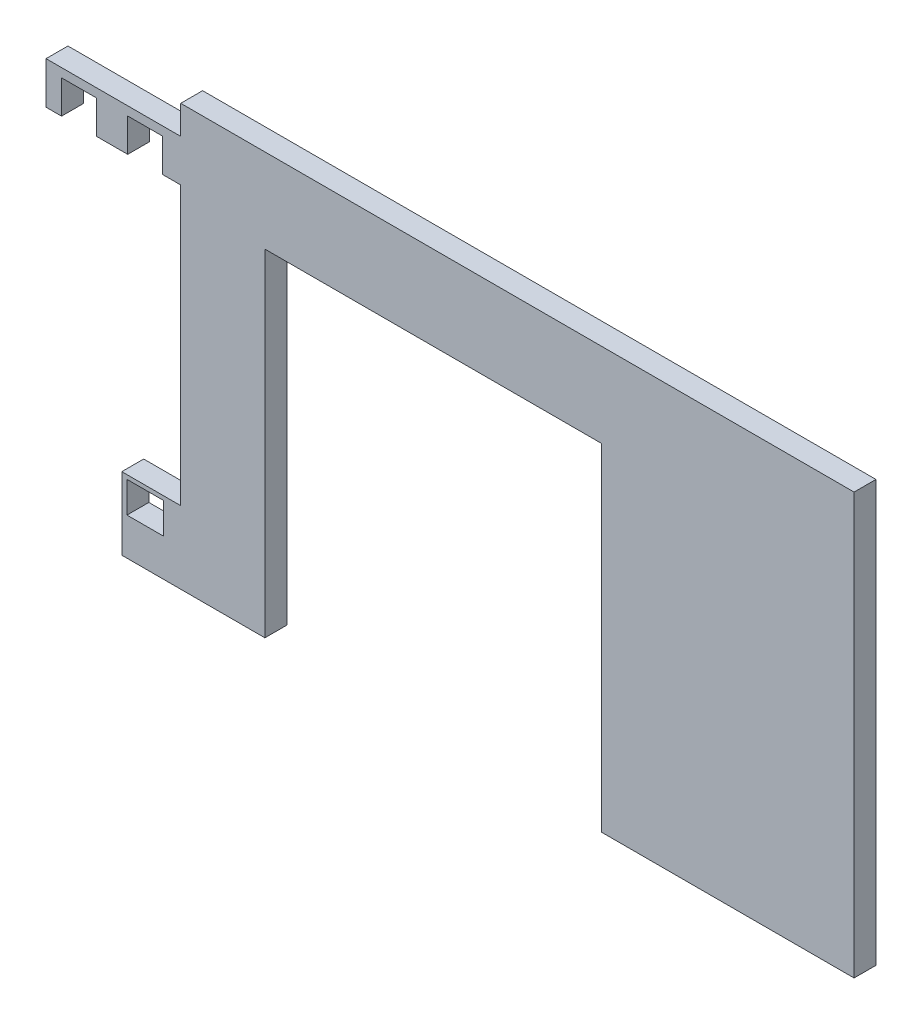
ISO-10303-21;
HEADER;
FILE_DESCRIPTION(('STEP AP214'),'2;1');
FILE_NAME('part.step','',(''),(''),'','','');
FILE_SCHEMA(('AUTOMOTIVE_DESIGN { 1 0 10303 214 1 1 1 1 }'));
ENDSEC;
DATA;
#1=APPLICATION_CONTEXT('core data for automotive mechanical design processes');
#2=APPLICATION_PROTOCOL_DEFINITION('international standard','automotive_design',2000,#1);
#3=PRODUCT_CONTEXT('',#1,'mechanical');
#4=PRODUCT('Part','Part','',(#3));
#5=PRODUCT_RELATED_PRODUCT_CATEGORY('part','',(#4));
#6=PRODUCT_DEFINITION_FORMATION('','',#4);
#7=PRODUCT_DEFINITION_CONTEXT('part definition',#1,'design');
#8=PRODUCT_DEFINITION('design','',#6,#7);
#9=PRODUCT_DEFINITION_SHAPE('','',#8);
#10=(LENGTH_UNIT() NAMED_UNIT(*) SI_UNIT(.MILLI.,.METRE.));
#11=(NAMED_UNIT(*) PLANE_ANGLE_UNIT() SI_UNIT($,.RADIAN.));
#12=(NAMED_UNIT(*) SI_UNIT($,.STERADIAN.) SOLID_ANGLE_UNIT());
#13=UNCERTAINTY_MEASURE_WITH_UNIT(LENGTH_MEASURE(1.E-05),#10,'distance_accuracy_value','');
#14=(GEOMETRIC_REPRESENTATION_CONTEXT(3) GLOBAL_UNCERTAINTY_ASSIGNED_CONTEXT((#13)) GLOBAL_UNIT_ASSIGNED_CONTEXT((#10,
#11,#12)) REPRESENTATION_CONTEXT('',''));
#15=CARTESIAN_POINT('',(0.,0.,0.));
#16=DIRECTION('',(0.,0.,1.));
#17=DIRECTION('',(1.,0.,0.));
#18=AXIS2_PLACEMENT_3D('',#15,#16,#17);
#19=CARTESIAN_POINT('',(-50.8,21.076628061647,21.2890793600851));
#20=DIRECTION('',(0.,-1.,0.));
#21=DIRECTION('',(0.,0.,1.));
#22=AXIS2_PLACEMENT_3D('',#19,#20,#21);
#23=PLANE('',#22);
#24=DIRECTION('',(0.,0.,-1.));
#25=VECTOR('',#24,1.);
#26=CARTESIAN_POINT('',(-68.7837095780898,21.076628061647,0.00100000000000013));
#27=LINE('',#26,#25);
#28=CARTESIAN_POINT('',(-68.7837095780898,21.076628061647,0.));
#29=VERTEX_POINT('',#28);
#30=CARTESIAN_POINT('',(-68.7837095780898,21.076628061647,-3.302));
#31=VERTEX_POINT('',#30);
#32=EDGE_CURVE('E217',#29,#31,#27,.T.);
#33=ORIENTED_EDGE('',*,*,#32,.F.);
#34=DIRECTION('',(-1.,0.,0.));
#35=VECTOR('',#34,1.);
#36=CARTESIAN_POINT('',(-50.8,21.076628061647,0.));
#37=LINE('',#36,#35);
#38=CARTESIAN_POINT('',(-71.12,21.076628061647,0.));
#39=VERTEX_POINT('',#38);
#40=EDGE_CURVE('E226',#29,#39,#37,.T.);
#41=ORIENTED_EDGE('',*,*,#40,.T.);
#42=DIRECTION('',(0.,0.,-1.));
#43=VECTOR('',#42,1.);
#44=CARTESIAN_POINT('',(-71.12,21.076628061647,21.2890793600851));
#45=LINE('',#44,#43);
#46=CARTESIAN_POINT('',(-71.12,21.076628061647,-3.302));
#47=VERTEX_POINT('',#46);
#48=EDGE_CURVE('E347',#39,#47,#45,.T.);
#49=ORIENTED_EDGE('',*,*,#48,.T.);
#50=DIRECTION('',(1.,0.,0.));
#51=VECTOR('',#50,1.);
#52=CARTESIAN_POINT('',(-50.8,21.076628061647,-3.302));
#53=LINE('',#52,#51);
#54=EDGE_CURVE('E239',#47,#31,#53,.T.);
#55=ORIENTED_EDGE('',*,*,#54,.T.);
#56=EDGE_LOOP('',(#33,#41,#49,#55));
#57=FACE_BOUND('',#56,.T.);
#58=ADVANCED_FACE('F37',(#57),#23,.T.);
#59=DIRECTION('',(0.,0.,1.));
#60=VECTOR('',#59,1.);
#61=CARTESIAN_POINT('',(-53.5162904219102,21.076628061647,0.00100000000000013));
#62=LINE('',#61,#60);
#63=CARTESIAN_POINT('',(-53.5162904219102,21.076628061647,-3.302));
#64=VERTEX_POINT('',#63);
#65=CARTESIAN_POINT('',(-53.5162904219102,21.076628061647,0.));
#66=VERTEX_POINT('',#65);
#67=EDGE_CURVE('E262',#64,#66,#62,.T.);
#68=ORIENTED_EDGE('',*,*,#67,.F.);
#69=CARTESIAN_POINT('',(-50.8,21.076628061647,-3.302));
#70=VERTEX_POINT('',#69);
#71=EDGE_CURVE('E341',#64,#70,#53,.T.);
#72=ORIENTED_EDGE('',*,*,#71,.T.);
#73=DIRECTION('',(0.,0.,-1.));
#74=VECTOR('',#73,1.);
#75=CARTESIAN_POINT('',(-50.8,21.076628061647,21.2890793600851));
#76=LINE('',#75,#74);
#77=CARTESIAN_POINT('',(-50.8,21.076628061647,0.));
#78=VERTEX_POINT('',#77);
#79=EDGE_CURVE('E333',#78,#70,#76,.T.);
#80=ORIENTED_EDGE('',*,*,#79,.F.);
#81=EDGE_CURVE('E236',#78,#66,#37,.T.);
#82=ORIENTED_EDGE('',*,*,#81,.T.);
#83=EDGE_LOOP('',(#68,#72,#80,#82));
#84=FACE_BOUND('',#83,.T.);
#85=ADVANCED_FACE('F465',(#84),#23,.T.);
#86=CARTESIAN_POINT('',(-50.8,-31.75,-3.302));
#87=DIRECTION('',(1.,0.,0.));
#88=DIRECTION('',(0.,0.,1.));
#89=AXIS2_PLACEMENT_3D('',#86,#87,#88);
#90=PLANE('',#89);
#91=DIRECTION('',(0.,-1.,0.));
#92=VECTOR('',#91,1.);
#93=CARTESIAN_POINT('',(-50.8,-31.75,0.));
#94=LINE('',#93,#92);
#95=CARTESIAN_POINT('',(-50.8,-20.828,0.));
#96=VERTEX_POINT('',#95);
#97=EDGE_CURVE('E373',#78,#96,#94,.T.);
#98=ORIENTED_EDGE('',*,*,#97,.F.);
#99=ORIENTED_EDGE('',*,*,#79,.T.);
#100=DIRECTION('',(0.,-1.,0.));
#101=VECTOR('',#100,1.);
#102=CARTESIAN_POINT('',(-50.8,-31.75,-3.302));
#103=LINE('',#102,#101);
#104=CARTESIAN_POINT('',(-50.8,-20.828,-3.302));
#105=VERTEX_POINT('',#104);
#106=EDGE_CURVE('E385',#70,#105,#103,.T.);
#107=ORIENTED_EDGE('',*,*,#106,.T.);
#108=DIRECTION('',(0.,0.,-1.));
#109=VECTOR('',#108,1.);
#110=CARTESIAN_POINT('',(-50.8,-20.828,21.2890793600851));
#111=LINE('',#110,#109);
#112=EDGE_CURVE('E324',#96,#105,#111,.T.);
#113=ORIENTED_EDGE('',*,*,#112,.F.);
#114=EDGE_LOOP('',(#98,#99,#107,#113));
#115=FACE_BOUND('',#114,.T.);
#116=ADVANCED_FACE('F471',(#115),#90,.F.);
#117=CARTESIAN_POINT('',(50.8,-31.75,-3.302));
#118=DIRECTION('',(0.,1.,0.));
#119=DIRECTION('',(0.,0.,-1.));
#120=AXIS2_PLACEMENT_3D('',#117,#118,#119);
#121=PLANE('',#120);
#122=DIRECTION('',(1.,0.,0.));
#123=VECTOR('',#122,1.);
#124=CARTESIAN_POINT('',(50.8,-31.75,0.));
#125=LINE('',#124,#123);
#126=CARTESIAN_POINT('',(-59.69,-31.75,0.));
#127=VERTEX_POINT('',#126);
#128=CARTESIAN_POINT('',(-38.1,-31.75,0.));
#129=VERTEX_POINT('',#128);
#130=EDGE_CURVE('E399',#127,#129,#125,.T.);
#131=ORIENTED_EDGE('',*,*,#130,.F.);
#132=DIRECTION('',(0.,0.,-1.));
#133=VECTOR('',#132,1.);
#134=CARTESIAN_POINT('',(-59.69,-31.75,21.2890793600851));
#135=LINE('',#134,#133);
#136=CARTESIAN_POINT('',(-59.69,-31.75,-3.302));
#137=VERTEX_POINT('',#136);
#138=EDGE_CURVE('E319',#127,#137,#135,.T.);
#139=ORIENTED_EDGE('',*,*,#138,.T.);
#140=DIRECTION('',(1.,0.,0.));
#141=VECTOR('',#140,1.);
#142=CARTESIAN_POINT('',(50.8,-31.75,-3.302));
#143=LINE('',#142,#141);
#144=CARTESIAN_POINT('',(-38.1,-31.75,-3.302));
#145=VERTEX_POINT('',#144);
#146=EDGE_CURVE('E386',#137,#145,#143,.T.);
#147=ORIENTED_EDGE('',*,*,#146,.T.);
#148=DIRECTION('',(0.,0.,-1.));
#149=VECTOR('',#148,1.);
#150=CARTESIAN_POINT('',(-38.1,-31.75,0.00100000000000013));
#151=LINE('',#150,#149);
#152=EDGE_CURVE('E370',#129,#145,#151,.T.);
#153=ORIENTED_EDGE('',*,*,#152,.F.);
#154=EDGE_LOOP('',(#131,#139,#147,#153));
#155=FACE_BOUND('',#154,.T.);
#156=ADVANCED_FACE('F482',(#155),#121,.F.);
#157=CARTESIAN_POINT('',(-50.8,31.75,0.));
#158=VERTEX_POINT('',#157);
#159=CARTESIAN_POINT('',(-50.8,27.426628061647,0.));
#160=VERTEX_POINT('',#159);
#161=EDGE_CURVE('E395',#158,#160,#94,.T.);
#162=ORIENTED_EDGE('',*,*,#161,.F.);
#163=DIRECTION('',(0.,0.,1.));
#164=VECTOR('',#163,1.);
#165=CARTESIAN_POINT('',(-50.8,31.75,-3.302));
#166=LINE('',#165,#164);
#167=CARTESIAN_POINT('',(-50.8,31.75,-3.302));
#168=VERTEX_POINT('',#167);
#169=EDGE_CURVE('E394',#168,#158,#166,.T.);
#170=ORIENTED_EDGE('',*,*,#169,.F.);
#171=CARTESIAN_POINT('',(-50.8,27.426628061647,-3.302));
#172=VERTEX_POINT('',#171);
#173=EDGE_CURVE('E381',#168,#172,#103,.T.);
#174=ORIENTED_EDGE('',*,*,#173,.T.);
#175=DIRECTION('',(0.,0.,-1.));
#176=VECTOR('',#175,1.);
#177=CARTESIAN_POINT('',(-50.8,27.426628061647,21.2890793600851));
#178=LINE('',#177,#176);
#179=EDGE_CURVE('E343',#160,#172,#178,.T.);
#180=ORIENTED_EDGE('',*,*,#179,.F.);
#181=EDGE_LOOP('',(#162,#170,#174,#180));
#182=FACE_BOUND('',#181,.T.);
#183=ADVANCED_FACE('F39',(#182),#90,.F.);
#184=CARTESIAN_POINT('',(12.7,-31.75,-3.302));
#185=VERTEX_POINT('',#184);
#186=CARTESIAN_POINT('',(50.8,-31.75,-3.302));
#187=VERTEX_POINT('',#186);
#188=EDGE_CURVE('E384',#185,#187,#143,.T.);
#189=ORIENTED_EDGE('',*,*,#188,.T.);
#190=DIRECTION('',(0.,0.,1.));
#191=VECTOR('',#190,1.);
#192=CARTESIAN_POINT('',(50.8,-31.75,-3.302));
#193=LINE('',#192,#191);
#194=CARTESIAN_POINT('',(50.8,-31.75,0.));
#195=VERTEX_POINT('',#194);
#196=EDGE_CURVE('E11',#187,#195,#193,.T.);
#197=ORIENTED_EDGE('',*,*,#196,.T.);
#198=CARTESIAN_POINT('',(12.7,-31.75,0.));
#199=VERTEX_POINT('',#198);
#200=EDGE_CURVE('E398',#199,#195,#125,.T.);
#201=ORIENTED_EDGE('',*,*,#200,.F.);
#202=DIRECTION('',(0.,0.,-1.));
#203=VECTOR('',#202,1.);
#204=CARTESIAN_POINT('',(12.7,-31.75,0.00100000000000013));
#205=LINE('',#204,#203);
#206=EDGE_CURVE('E376',#199,#185,#205,.T.);
#207=ORIENTED_EDGE('',*,*,#206,.T.);
#208=EDGE_LOOP('',(#189,#197,#201,#207));
#209=FACE_BOUND('',#208,.T.);
#210=ADVANCED_FACE('F420',(#209),#121,.F.);
#211=CARTESIAN_POINT('',(50.8,-31.75,-3.302));
#212=DIRECTION('',(-1.,0.,0.));
#213=DIRECTION('',(0.,0.,-1.));
#214=AXIS2_PLACEMENT_3D('',#211,#212,#213);
#215=PLANE('',#214);
#216=DIRECTION('',(0.,1.,0.));
#217=VECTOR('',#216,1.);
#218=CARTESIAN_POINT('',(50.8,-31.75,0.));
#219=LINE('',#218,#217);
#220=CARTESIAN_POINT('',(50.8,31.75,0.));
#221=VERTEX_POINT('',#220);
#222=EDGE_CURVE('E402',#195,#221,#219,.T.);
#223=ORIENTED_EDGE('',*,*,#222,.F.);
#224=ORIENTED_EDGE('',*,*,#196,.F.);
#225=DIRECTION('',(0.,1.,0.));
#226=VECTOR('',#225,1.);
#227=CARTESIAN_POINT('',(50.8,-31.75,-3.302));
#228=LINE('',#227,#226);
#229=CARTESIAN_POINT('',(50.8,31.75,-3.302));
#230=VERTEX_POINT('',#229);
#231=EDGE_CURVE('E389',#187,#230,#228,.T.);
#232=ORIENTED_EDGE('',*,*,#231,.T.);
#233=DIRECTION('',(0.,0.,1.));
#234=VECTOR('',#233,1.);
#235=CARTESIAN_POINT('',(50.8,31.75,-3.302));
#236=LINE('',#235,#234);
#237=EDGE_CURVE('E45',#230,#221,#236,.T.);
#238=ORIENTED_EDGE('',*,*,#237,.T.);
#239=EDGE_LOOP('',(#223,#224,#232,#238));
#240=FACE_BOUND('',#239,.T.);
#241=ADVANCED_FACE('F411',(#240),#215,.F.);
#242=CARTESIAN_POINT('',(50.8,31.75,-3.302));
#243=DIRECTION('',(0.,-1.,0.));
#244=DIRECTION('',(0.,0.,1.));
#245=AXIS2_PLACEMENT_3D('',#242,#243,#244);
#246=PLANE('',#245);
#247=DIRECTION('',(-1.,0.,0.));
#248=VECTOR('',#247,1.);
#249=CARTESIAN_POINT('',(50.8,31.75,0.));
#250=LINE('',#249,#248);
#251=EDGE_CURVE('E405',#221,#158,#250,.T.);
#252=ORIENTED_EDGE('',*,*,#251,.F.);
#253=ORIENTED_EDGE('',*,*,#237,.F.);
#254=DIRECTION('',(-1.,0.,0.));
#255=VECTOR('',#254,1.);
#256=CARTESIAN_POINT('',(50.8,31.75,-3.302));
#257=LINE('',#256,#255);
#258=EDGE_CURVE('E392',#230,#168,#257,.T.);
#259=ORIENTED_EDGE('',*,*,#258,.T.);
#260=ORIENTED_EDGE('',*,*,#169,.T.);
#261=EDGE_LOOP('',(#252,#253,#259,#260));
#262=FACE_BOUND('',#261,.T.);
#263=ADVANCED_FACE('F427',(#262),#246,.F.);
#264=CARTESIAN_POINT('',(0.,0.,-3.302));
#265=DIRECTION('',(0.,0.,-1.));
#266=DIRECTION('',(1.,0.,0.));
#267=AXIS2_PLACEMENT_3D('',#264,#265,#266);
#268=PLANE('',#267);
#269=DIRECTION('',(0.,-1.,0.));
#270=VECTOR('',#269,1.);
#271=CARTESIAN_POINT('',(-68.7837095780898,26.0929863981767,-3.302));
#272=LINE('',#271,#270);
#273=CARTESIAN_POINT('',(-68.7837095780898,26.0929863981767,-3.302));
#274=VERTEX_POINT('',#273);
#275=EDGE_CURVE('E222',#274,#31,#272,.T.);
#276=ORIENTED_EDGE('',*,*,#275,.T.);
#277=ORIENTED_EDGE('',*,*,#54,.F.);
#278=DIRECTION('',(0.,-1.,0.));
#279=VECTOR('',#278,1.);
#280=CARTESIAN_POINT('',(-71.12,21.076628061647,-3.302));
#281=LINE('',#280,#279);
#282=CARTESIAN_POINT('',(-71.12,27.426628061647,-3.302));
#283=VERTEX_POINT('',#282);
#284=EDGE_CURVE('E339',#283,#47,#281,.T.);
#285=ORIENTED_EDGE('',*,*,#284,.F.);
#286=DIRECTION('',(-1.,0.,0.));
#287=VECTOR('',#286,1.);
#288=CARTESIAN_POINT('',(-50.8,27.426628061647,-3.302));
#289=LINE('',#288,#287);
#290=EDGE_CURVE('E332',#172,#283,#289,.T.);
#291=ORIENTED_EDGE('',*,*,#290,.F.);
#292=ORIENTED_EDGE('',*,*,#173,.F.);
#293=ORIENTED_EDGE('',*,*,#258,.F.);
#294=ORIENTED_EDGE('',*,*,#231,.F.);
#295=ORIENTED_EDGE('',*,*,#188,.F.);
#296=DIRECTION('',(0.,1.,0.));
#297=VECTOR('',#296,1.);
#298=CARTESIAN_POINT('',(12.7,-31.75,-3.302));
#299=LINE('',#298,#297);
#300=CARTESIAN_POINT('',(12.7,19.05,-3.302));
#301=VERTEX_POINT('',#300);
#302=EDGE_CURVE('E364',#185,#301,#299,.T.);
#303=ORIENTED_EDGE('',*,*,#302,.T.);
#304=DIRECTION('',(-1.,0.,0.));
#305=VECTOR('',#304,1.);
#306=CARTESIAN_POINT('',(-38.1,19.05,-3.302));
#307=LINE('',#306,#305);
#308=CARTESIAN_POINT('',(-38.1,19.05,-3.302));
#309=VERTEX_POINT('',#308);
#310=EDGE_CURVE('E367',#301,#309,#307,.T.);
#311=ORIENTED_EDGE('',*,*,#310,.T.);
#312=DIRECTION('',(0.,-1.,0.));
#313=VECTOR('',#312,1.);
#314=CARTESIAN_POINT('',(-38.1,-31.75,-3.302));
#315=LINE('',#314,#313);
#316=EDGE_CURVE('E362',#309,#145,#315,.T.);
#317=ORIENTED_EDGE('',*,*,#316,.T.);
#318=ORIENTED_EDGE('',*,*,#146,.F.);
#319=DIRECTION('',(0.,-1.,0.));
#320=VECTOR('',#319,1.);
#321=CARTESIAN_POINT('',(-59.69,-31.75,-3.302));
#322=LINE('',#321,#320);
#323=CARTESIAN_POINT('',(-59.69,-20.828,-3.302));
#324=VERTEX_POINT('',#323);
#325=EDGE_CURVE('E322',#324,#137,#322,.T.);
#326=ORIENTED_EDGE('',*,*,#325,.F.);
#327=DIRECTION('',(-1.,0.,0.));
#328=VECTOR('',#327,1.);
#329=CARTESIAN_POINT('',(-50.8,-20.828,-3.302));
#330=LINE('',#329,#328);
#331=EDGE_CURVE('E259',#105,#324,#330,.T.);
#332=ORIENTED_EDGE('',*,*,#331,.F.);
#333=ORIENTED_EDGE('',*,*,#106,.F.);
#334=ORIENTED_EDGE('',*,*,#71,.F.);
#335=DIRECTION('',(0.,1.,0.));
#336=VECTOR('',#335,1.);
#337=CARTESIAN_POINT('',(-53.5162904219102,26.0929863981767,-3.302));
#338=LINE('',#337,#336);
#339=CARTESIAN_POINT('',(-53.5162904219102,26.0929863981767,-3.302));
#340=VERTEX_POINT('',#339);
#341=EDGE_CURVE('E277',#64,#340,#338,.T.);
#342=ORIENTED_EDGE('',*,*,#341,.T.);
#343=DIRECTION('',(-1.,0.,0.));
#344=VECTOR('',#343,1.);
#345=CARTESIAN_POINT('',(-53.5162904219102,26.0929863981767,-3.302));
#346=LINE('',#345,#344);
#347=CARTESIAN_POINT('',(-58.8011335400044,26.0929863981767,-3.302));
#348=VERTEX_POINT('',#347);
#349=EDGE_CURVE('E271',#340,#348,#346,.T.);
#350=ORIENTED_EDGE('',*,*,#349,.T.);
#351=DIRECTION('',(0.,-1.,0.));
#352=VECTOR('',#351,1.);
#353=CARTESIAN_POINT('',(-58.8011335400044,26.0929863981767,-3.302));
#354=LINE('',#353,#352);
#355=CARTESIAN_POINT('',(-58.8011335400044,21.076628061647,-3.302));
#356=VERTEX_POINT('',#355);
#357=EDGE_CURVE('E274',#348,#356,#354,.T.);
#358=ORIENTED_EDGE('',*,*,#357,.T.);
#359=CARTESIAN_POINT('',(-63.4988664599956,21.076628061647,-3.302));
#360=VERTEX_POINT('',#359);
#361=EDGE_CURVE('E344',#360,#356,#53,.T.);
#362=ORIENTED_EDGE('',*,*,#361,.F.);
#363=DIRECTION('',(0.,1.,0.));
#364=VECTOR('',#363,1.);
#365=CARTESIAN_POINT('',(-63.4988664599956,26.0929863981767,-3.302));
#366=LINE('',#365,#364);
#367=CARTESIAN_POINT('',(-63.4988664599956,26.0929863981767,-3.302));
#368=VERTEX_POINT('',#367);
#369=EDGE_CURVE('E247',#360,#368,#366,.T.);
#370=ORIENTED_EDGE('',*,*,#369,.T.);
#371=DIRECTION('',(-1.,0.,0.));
#372=VECTOR('',#371,1.);
#373=CARTESIAN_POINT('',(-68.7837095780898,26.0929863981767,-3.302));
#374=LINE('',#373,#372);
#375=EDGE_CURVE('E250',#368,#274,#374,.T.);
#376=ORIENTED_EDGE('',*,*,#375,.T.);
#377=EDGE_LOOP('',(#276,#277,#285,#291,#292,#293,#294,#295,#303,#311,#317,#318,#326,#332,#333,
#334,#342,#350,#358,#362,#370,#376));
#378=FACE_BOUND('',#377,.T.);
#379=DIRECTION('',(0.,-1.,0.));
#380=VECTOR('',#379,1.);
#381=CARTESIAN_POINT('',(-58.9105914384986,-21.444804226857,-3.302));
#382=LINE('',#381,#380);
#383=CARTESIAN_POINT('',(-58.9105914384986,-21.444804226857,-3.302));
#384=VERTEX_POINT('',#383);
#385=CARTESIAN_POINT('',(-58.9105914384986,-26.1131993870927,-3.302));
#386=VERTEX_POINT('',#385);
#387=EDGE_CURVE('E295',#384,#386,#382,.T.);
#388=ORIENTED_EDGE('',*,*,#387,.T.);
#389=DIRECTION('',(1.,0.,0.));
#390=VECTOR('',#389,1.);
#391=CARTESIAN_POINT('',(-58.9105914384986,-26.1131993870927,-3.302));
#392=LINE('',#391,#390);
#393=CARTESIAN_POINT('',(-53.3876390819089,-26.1131993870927,-3.302));
#394=VERTEX_POINT('',#393);
#395=EDGE_CURVE('E298',#386,#394,#392,.T.);
#396=ORIENTED_EDGE('',*,*,#395,.T.);
#397=DIRECTION('',(0.,1.,0.));
#398=VECTOR('',#397,1.);
#399=CARTESIAN_POINT('',(-53.3876390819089,-21.444804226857,-3.302));
#400=LINE('',#399,#398);
#401=CARTESIAN_POINT('',(-53.3876390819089,-21.444804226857,-3.302));
#402=VERTEX_POINT('',#401);
#403=EDGE_CURVE('E301',#394,#402,#400,.T.);
#404=ORIENTED_EDGE('',*,*,#403,.T.);
#405=DIRECTION('',(-1.,0.,0.));
#406=VECTOR('',#405,1.);
#407=CARTESIAN_POINT('',(-58.9105914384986,-21.444804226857,-3.302));
#408=LINE('',#407,#406);
#409=EDGE_CURVE('E304',#402,#384,#408,.T.);
#410=ORIENTED_EDGE('',*,*,#409,.T.);
#411=EDGE_LOOP('',(#388,#396,#404,#410));
#412=FACE_BOUND('',#411,.T.);
#413=ADVANCED_FACE('F423',(#378,#412),#268,.T.);
#414=CARTESIAN_POINT('',(0.,0.,0.));
#415=DIRECTION('',(0.,0.,-1.));
#416=DIRECTION('',(1.,0.,0.));
#417=AXIS2_PLACEMENT_3D('',#414,#415,#416);
#418=PLANE('',#417);
#419=DIRECTION('',(1.,0.,0.));
#420=VECTOR('',#419,1.);
#421=CARTESIAN_POINT('',(-58.9105914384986,-21.444804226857,0.));
#422=LINE('',#421,#420);
#423=CARTESIAN_POINT('',(-58.9105914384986,-21.444804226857,0.));
#424=VERTEX_POINT('',#423);
#425=CARTESIAN_POINT('',(-53.3876390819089,-21.444804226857,0.));
#426=VERTEX_POINT('',#425);
#427=EDGE_CURVE('E289',#424,#426,#422,.T.);
#428=ORIENTED_EDGE('',*,*,#427,.T.);
#429=DIRECTION('',(0.,-1.,0.));
#430=VECTOR('',#429,1.);
#431=CARTESIAN_POINT('',(-53.3876390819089,-21.444804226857,0.));
#432=LINE('',#431,#430);
#433=CARTESIAN_POINT('',(-53.3876390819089,-26.1131993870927,0.));
#434=VERTEX_POINT('',#433);
#435=EDGE_CURVE('E286',#426,#434,#432,.T.);
#436=ORIENTED_EDGE('',*,*,#435,.T.);
#437=DIRECTION('',(-1.,0.,0.));
#438=VECTOR('',#437,1.);
#439=CARTESIAN_POINT('',(-58.9105914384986,-26.1131993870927,0.));
#440=LINE('',#439,#438);
#441=CARTESIAN_POINT('',(-58.9105914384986,-26.1131993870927,0.));
#442=VERTEX_POINT('',#441);
#443=EDGE_CURVE('E263',#434,#442,#440,.T.);
#444=ORIENTED_EDGE('',*,*,#443,.T.);
#445=DIRECTION('',(0.,1.,0.));
#446=VECTOR('',#445,1.);
#447=CARTESIAN_POINT('',(-58.9105914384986,-21.444804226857,0.));
#448=LINE('',#447,#446);
#449=EDGE_CURVE('E292',#442,#424,#448,.T.);
#450=ORIENTED_EDGE('',*,*,#449,.T.);
#451=EDGE_LOOP('',(#428,#436,#444,#450));
#452=FACE_BOUND('',#451,.T.);
#453=DIRECTION('',(1.,0.,0.));
#454=VECTOR('',#453,1.);
#455=CARTESIAN_POINT('',(-68.7837095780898,26.0929863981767,0.));
#456=LINE('',#455,#454);
#457=CARTESIAN_POINT('',(-68.7837095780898,26.0929863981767,0.));
#458=VERTEX_POINT('',#457);
#459=CARTESIAN_POINT('',(-63.4988664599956,26.0929863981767,0.));
#460=VERTEX_POINT('',#459);
#461=EDGE_CURVE('E223',#458,#460,#456,.T.);
#462=ORIENTED_EDGE('',*,*,#461,.T.);
#463=DIRECTION('',(0.,-1.,0.));
#464=VECTOR('',#463,1.);
#465=CARTESIAN_POINT('',(-63.4988664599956,26.0929863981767,0.));
#466=LINE('',#465,#464);
#467=CARTESIAN_POINT('',(-63.4988664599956,21.076628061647,0.));
#468=VERTEX_POINT('',#467);
#469=EDGE_CURVE('E255',#460,#468,#466,.T.);
#470=ORIENTED_EDGE('',*,*,#469,.T.);
#471=CARTESIAN_POINT('',(-58.8011335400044,21.076628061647,0.));
#472=VERTEX_POINT('',#471);
#473=EDGE_CURVE('E234',#472,#468,#37,.T.);
#474=ORIENTED_EDGE('',*,*,#473,.F.);
#475=DIRECTION('',(0.,1.,0.));
#476=VECTOR('',#475,1.);
#477=CARTESIAN_POINT('',(-58.8011335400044,26.0929863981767,0.));
#478=LINE('',#477,#476);
#479=CARTESIAN_POINT('',(-58.8011335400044,26.0929863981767,0.));
#480=VERTEX_POINT('',#479);
#481=EDGE_CURVE('E243',#472,#480,#478,.T.);
#482=ORIENTED_EDGE('',*,*,#481,.T.);
#483=DIRECTION('',(1.,0.,0.));
#484=VECTOR('',#483,1.);
#485=CARTESIAN_POINT('',(-53.5162904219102,26.0929863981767,0.));
#486=LINE('',#485,#484);
#487=CARTESIAN_POINT('',(-53.5162904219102,26.0929863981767,0.));
#488=VERTEX_POINT('',#487);
#489=EDGE_CURVE('E266',#480,#488,#486,.T.);
#490=ORIENTED_EDGE('',*,*,#489,.T.);
#491=DIRECTION('',(0.,-1.,0.));
#492=VECTOR('',#491,1.);
#493=CARTESIAN_POINT('',(-53.5162904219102,26.0929863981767,0.));
#494=LINE('',#493,#492);
#495=EDGE_CURVE('E269',#488,#66,#494,.T.);
#496=ORIENTED_EDGE('',*,*,#495,.T.);
#497=ORIENTED_EDGE('',*,*,#81,.F.);
#498=ORIENTED_EDGE('',*,*,#97,.T.);
#499=DIRECTION('',(1.,0.,0.));
#500=VECTOR('',#499,1.);
#501=CARTESIAN_POINT('',(-50.8,-20.828,0.));
#502=LINE('',#501,#500);
#503=CARTESIAN_POINT('',(-59.69,-20.828,0.));
#504=VERTEX_POINT('',#503);
#505=EDGE_CURVE('E318',#504,#96,#502,.T.);
#506=ORIENTED_EDGE('',*,*,#505,.F.);
#507=DIRECTION('',(0.,1.,0.));
#508=VECTOR('',#507,1.);
#509=CARTESIAN_POINT('',(-59.69,-31.75,0.));
#510=LINE('',#509,#508);
#511=EDGE_CURVE('E315',#127,#504,#510,.T.);
#512=ORIENTED_EDGE('',*,*,#511,.F.);
#513=ORIENTED_EDGE('',*,*,#130,.T.);
#514=DIRECTION('',(0.,1.,0.));
#515=VECTOR('',#514,1.);
#516=CARTESIAN_POINT('',(-38.1,-31.75,0.));
#517=LINE('',#516,#515);
#518=CARTESIAN_POINT('',(-38.1,19.05,0.));
#519=VERTEX_POINT('',#518);
#520=EDGE_CURVE('E359',#129,#519,#517,.T.);
#521=ORIENTED_EDGE('',*,*,#520,.T.);
#522=DIRECTION('',(1.,0.,0.));
#523=VECTOR('',#522,1.);
#524=CARTESIAN_POINT('',(-38.1,19.05,0.));
#525=LINE('',#524,#523);
#526=CARTESIAN_POINT('',(12.7,19.05,0.));
#527=VERTEX_POINT('',#526);
#528=EDGE_CURVE('E356',#519,#527,#525,.T.);
#529=ORIENTED_EDGE('',*,*,#528,.T.);
#530=DIRECTION('',(0.,-1.,0.));
#531=VECTOR('',#530,1.);
#532=CARTESIAN_POINT('',(12.7,-31.75,0.));
#533=LINE('',#532,#531);
#534=EDGE_CURVE('E354',#527,#199,#533,.T.);
#535=ORIENTED_EDGE('',*,*,#534,.T.);
#536=ORIENTED_EDGE('',*,*,#200,.T.);
#537=ORIENTED_EDGE('',*,*,#222,.T.);
#538=ORIENTED_EDGE('',*,*,#251,.T.);
#539=ORIENTED_EDGE('',*,*,#161,.T.);
#540=DIRECTION('',(1.,0.,0.));
#541=VECTOR('',#540,1.);
#542=CARTESIAN_POINT('',(-50.8,27.426628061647,0.));
#543=LINE('',#542,#541);
#544=CARTESIAN_POINT('',(-71.12,27.426628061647,0.));
#545=VERTEX_POINT('',#544);
#546=EDGE_CURVE('E336',#545,#160,#543,.T.);
#547=ORIENTED_EDGE('',*,*,#546,.F.);
#548=DIRECTION('',(0.,1.,0.));
#549=VECTOR('',#548,1.);
#550=CARTESIAN_POINT('',(-71.12,21.076628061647,0.));
#551=LINE('',#550,#549);
#552=EDGE_CURVE('E230',#39,#545,#551,.T.);
#553=ORIENTED_EDGE('',*,*,#552,.F.);
#554=ORIENTED_EDGE('',*,*,#40,.F.);
#555=DIRECTION('',(0.,1.,0.));
#556=VECTOR('',#555,1.);
#557=CARTESIAN_POINT('',(-68.7837095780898,26.0929863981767,0.));
#558=LINE('',#557,#556);
#559=EDGE_CURVE('E212',#29,#458,#558,.T.);
#560=ORIENTED_EDGE('',*,*,#559,.T.);
#561=EDGE_LOOP('',(#462,#470,#474,#482,#490,#496,#497,#498,#506,#512,#513,#521,#529,#535,#536,
#537,#538,#539,#547,#553,#554,#560));
#562=FACE_BOUND('',#561,.T.);
#563=ADVANCED_FACE('F227',(#452,#562),#418,.F.);
#564=CARTESIAN_POINT('',(-38.1,-31.75,0.00100000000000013));
#565=DIRECTION('',(-1.,0.,0.));
#566=DIRECTION('',(0.,0.,-1.));
#567=AXIS2_PLACEMENT_3D('',#564,#565,#566);
#568=PLANE('',#567);
#569=ORIENTED_EDGE('',*,*,#520,.F.);
#570=ORIENTED_EDGE('',*,*,#152,.T.);
#571=ORIENTED_EDGE('',*,*,#316,.F.);
#572=DIRECTION('',(0.,0.,-1.));
#573=VECTOR('',#572,1.);
#574=CARTESIAN_POINT('',(-38.1,19.05,0.00100000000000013));
#575=LINE('',#574,#573);
#576=EDGE_CURVE('E371',#519,#309,#575,.T.);
#577=ORIENTED_EDGE('',*,*,#576,.F.);
#578=EDGE_LOOP('',(#569,#570,#571,#577));
#579=FACE_BOUND('',#578,.T.);
#580=ADVANCED_FACE('F486',(#579),#568,.F.);
#581=CARTESIAN_POINT('',(-38.1,19.05,0.00100000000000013));
#582=DIRECTION('',(0.,1.,0.));
#583=DIRECTION('',(0.,0.,-1.));
#584=AXIS2_PLACEMENT_3D('',#581,#582,#583);
#585=PLANE('',#584);
#586=ORIENTED_EDGE('',*,*,#528,.F.);
#587=ORIENTED_EDGE('',*,*,#576,.T.);
#588=ORIENTED_EDGE('',*,*,#310,.F.);
#589=DIRECTION('',(0.,0.,-1.));
#590=VECTOR('',#589,1.);
#591=CARTESIAN_POINT('',(12.7,19.05,0.00100000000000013));
#592=LINE('',#591,#590);
#593=EDGE_CURVE('E374',#527,#301,#592,.T.);
#594=ORIENTED_EDGE('',*,*,#593,.F.);
#595=EDGE_LOOP('',(#586,#587,#588,#594));
#596=FACE_BOUND('',#595,.T.);
#597=ADVANCED_FACE('F490',(#596),#585,.F.);
#598=CARTESIAN_POINT('',(12.7,-31.75,0.00100000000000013));
#599=DIRECTION('',(1.,0.,0.));
#600=DIRECTION('',(0.,0.,1.));
#601=AXIS2_PLACEMENT_3D('',#598,#599,#600);
#602=PLANE('',#601);
#603=ORIENTED_EDGE('',*,*,#534,.F.);
#604=ORIENTED_EDGE('',*,*,#593,.T.);
#605=ORIENTED_EDGE('',*,*,#302,.F.);
#606=ORIENTED_EDGE('',*,*,#206,.F.);
#607=EDGE_LOOP('',(#603,#604,#605,#606));
#608=FACE_BOUND('',#607,.T.);
#609=ADVANCED_FACE('F492',(#608),#602,.F.);
#610=DIRECTION('',(0.,0.,1.));
#611=VECTOR('',#610,1.);
#612=CARTESIAN_POINT('',(-63.4988664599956,21.076628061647,0.00100000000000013));
#613=LINE('',#612,#611);
#614=EDGE_CURVE('E240',#360,#468,#613,.T.);
#615=ORIENTED_EDGE('',*,*,#614,.F.);
#616=ORIENTED_EDGE('',*,*,#361,.T.);
#617=DIRECTION('',(0.,0.,-1.));
#618=VECTOR('',#617,1.);
#619=CARTESIAN_POINT('',(-58.8011335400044,21.076628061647,0.00100000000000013));
#620=LINE('',#619,#618);
#621=EDGE_CURVE('E260',#472,#356,#620,.T.);
#622=ORIENTED_EDGE('',*,*,#621,.F.);
#623=ORIENTED_EDGE('',*,*,#473,.T.);
#624=EDGE_LOOP('',(#615,#616,#622,#623));
#625=FACE_BOUND('',#624,.T.);
#626=ADVANCED_FACE('F448',(#625),#23,.T.);
#627=CARTESIAN_POINT('',(-71.12,21.076628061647,21.2890793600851));
#628=DIRECTION('',(-1.,0.,0.));
#629=DIRECTION('',(0.,0.,-1.));
#630=AXIS2_PLACEMENT_3D('',#627,#628,#629);
#631=PLANE('',#630);
#632=ORIENTED_EDGE('',*,*,#552,.T.);
#633=DIRECTION('',(0.,0.,-1.));
#634=VECTOR('',#633,1.);
#635=CARTESIAN_POINT('',(-71.12,27.426628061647,21.2890793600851));
#636=LINE('',#635,#634);
#637=EDGE_CURVE('E349',#545,#283,#636,.T.);
#638=ORIENTED_EDGE('',*,*,#637,.T.);
#639=ORIENTED_EDGE('',*,*,#284,.T.);
#640=ORIENTED_EDGE('',*,*,#48,.F.);
#641=EDGE_LOOP('',(#632,#638,#639,#640));
#642=FACE_BOUND('',#641,.T.);
#643=ADVANCED_FACE('F435',(#642),#631,.T.);
#644=CARTESIAN_POINT('',(-50.8,27.426628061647,21.2890793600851));
#645=DIRECTION('',(0.,1.,0.));
#646=DIRECTION('',(0.,0.,-1.));
#647=AXIS2_PLACEMENT_3D('',#644,#645,#646);
#648=PLANE('',#647);
#649=ORIENTED_EDGE('',*,*,#546,.T.);
#650=ORIENTED_EDGE('',*,*,#179,.T.);
#651=ORIENTED_EDGE('',*,*,#290,.T.);
#652=ORIENTED_EDGE('',*,*,#637,.F.);
#653=EDGE_LOOP('',(#649,#650,#651,#652));
#654=FACE_BOUND('',#653,.T.);
#655=ADVANCED_FACE('F432',(#654),#648,.T.);
#656=CARTESIAN_POINT('',(-59.69,-31.75,21.2890793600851));
#657=DIRECTION('',(-1.,0.,0.));
#658=DIRECTION('',(0.,-1.,0.));
#659=AXIS2_PLACEMENT_3D('',#656,#657,#658);
#660=PLANE('',#659);
#661=ORIENTED_EDGE('',*,*,#511,.T.);
#662=DIRECTION('',(0.,0.,-1.));
#663=VECTOR('',#662,1.);
#664=CARTESIAN_POINT('',(-59.69,-20.828,21.2890793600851));
#665=LINE('',#664,#663);
#666=EDGE_CURVE('E327',#504,#324,#665,.T.);
#667=ORIENTED_EDGE('',*,*,#666,.T.);
#668=ORIENTED_EDGE('',*,*,#325,.T.);
#669=ORIENTED_EDGE('',*,*,#138,.F.);
#670=EDGE_LOOP('',(#661,#667,#668,#669));
#671=FACE_BOUND('',#670,.T.);
#672=ADVANCED_FACE('F478',(#671),#660,.T.);
#673=CARTESIAN_POINT('',(-50.8,-20.828,21.2890793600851));
#674=DIRECTION('',(0.,1.,0.));
#675=DIRECTION('',(0.,0.,-1.));
#676=AXIS2_PLACEMENT_3D('',#673,#674,#675);
#677=PLANE('',#676);
#678=ORIENTED_EDGE('',*,*,#505,.T.);
#679=ORIENTED_EDGE('',*,*,#112,.T.);
#680=ORIENTED_EDGE('',*,*,#331,.T.);
#681=ORIENTED_EDGE('',*,*,#666,.F.);
#682=EDGE_LOOP('',(#678,#679,#680,#681));
#683=FACE_BOUND('',#682,.T.);
#684=ADVANCED_FACE('F474',(#683),#677,.T.);
#685=CARTESIAN_POINT('',(-53.5162904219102,26.0929863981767,0.00100000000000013));
#686=DIRECTION('',(0.,1.,0.));
#687=DIRECTION('',(0.,0.,-1.));
#688=AXIS2_PLACEMENT_3D('',#685,#686,#687);
#689=PLANE('',#688);
#690=ORIENTED_EDGE('',*,*,#489,.F.);
#691=DIRECTION('',(0.,0.,-1.));
#692=VECTOR('',#691,1.);
#693=CARTESIAN_POINT('',(-58.8011335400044,26.0929863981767,0.00100000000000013));
#694=LINE('',#693,#692);
#695=EDGE_CURVE('E280',#480,#348,#694,.T.);
#696=ORIENTED_EDGE('',*,*,#695,.T.);
#697=ORIENTED_EDGE('',*,*,#349,.F.);
#698=DIRECTION('',(0.,0.,-1.));
#699=VECTOR('',#698,1.);
#700=CARTESIAN_POINT('',(-53.5162904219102,26.0929863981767,0.00100000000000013));
#701=LINE('',#700,#699);
#702=EDGE_CURVE('E281',#488,#340,#701,.T.);
#703=ORIENTED_EDGE('',*,*,#702,.F.);
#704=EDGE_LOOP('',(#690,#696,#697,#703));
#705=FACE_BOUND('',#704,.T.);
#706=ADVANCED_FACE('F457',(#705),#689,.F.);
#707=CARTESIAN_POINT('',(-53.5162904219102,26.0929863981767,0.00100000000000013));
#708=DIRECTION('',(1.,0.,0.));
#709=DIRECTION('',(0.,0.,1.));
#710=AXIS2_PLACEMENT_3D('',#707,#708,#709);
#711=PLANE('',#710);
#712=ORIENTED_EDGE('',*,*,#495,.F.);
#713=ORIENTED_EDGE('',*,*,#702,.T.);
#714=ORIENTED_EDGE('',*,*,#341,.F.);
#715=ORIENTED_EDGE('',*,*,#67,.T.);
#716=EDGE_LOOP('',(#712,#713,#714,#715));
#717=FACE_BOUND('',#716,.T.);
#718=ADVANCED_FACE('F460',(#717),#711,.F.);
#719=CARTESIAN_POINT('',(-58.8011335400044,26.0929863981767,0.00100000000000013));
#720=DIRECTION('',(-1.,0.,0.));
#721=DIRECTION('',(0.,0.,-1.));
#722=AXIS2_PLACEMENT_3D('',#719,#720,#721);
#723=PLANE('',#722);
#724=ORIENTED_EDGE('',*,*,#481,.F.);
#725=ORIENTED_EDGE('',*,*,#621,.T.);
#726=ORIENTED_EDGE('',*,*,#357,.F.);
#727=ORIENTED_EDGE('',*,*,#695,.F.);
#728=EDGE_LOOP('',(#724,#725,#726,#727));
#729=FACE_BOUND('',#728,.T.);
#730=ADVANCED_FACE('F452',(#729),#723,.F.);
#731=CARTESIAN_POINT('',(-68.7837095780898,26.0929863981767,0.00100000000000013));
#732=DIRECTION('',(-1.,0.,0.));
#733=DIRECTION('',(0.,0.,-1.));
#734=AXIS2_PLACEMENT_3D('',#731,#732,#733);
#735=PLANE('',#734);
#736=ORIENTED_EDGE('',*,*,#559,.F.);
#737=ORIENTED_EDGE('',*,*,#32,.T.);
#738=ORIENTED_EDGE('',*,*,#275,.F.);
#739=DIRECTION('',(0.,0.,-1.));
#740=VECTOR('',#739,1.);
#741=CARTESIAN_POINT('',(-68.7837095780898,26.0929863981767,0.00100000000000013));
#742=LINE('',#741,#740);
#743=EDGE_CURVE('E218',#458,#274,#742,.T.);
#744=ORIENTED_EDGE('',*,*,#743,.F.);
#745=EDGE_LOOP('',(#736,#737,#738,#744));
#746=FACE_BOUND('',#745,.T.);
#747=ADVANCED_FACE('F214',(#746),#735,.F.);
#748=CARTESIAN_POINT('',(-68.7837095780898,26.0929863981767,0.00100000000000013));
#749=DIRECTION('',(0.,1.,0.));
#750=DIRECTION('',(0.,0.,-1.));
#751=AXIS2_PLACEMENT_3D('',#748,#749,#750);
#752=PLANE('',#751);
#753=ORIENTED_EDGE('',*,*,#461,.F.);
#754=ORIENTED_EDGE('',*,*,#743,.T.);
#755=ORIENTED_EDGE('',*,*,#375,.F.);
#756=DIRECTION('',(0.,0.,-1.));
#757=VECTOR('',#756,1.);
#758=CARTESIAN_POINT('',(-63.4988664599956,26.0929863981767,0.00100000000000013));
#759=LINE('',#758,#757);
#760=EDGE_CURVE('E253',#460,#368,#759,.T.);
#761=ORIENTED_EDGE('',*,*,#760,.F.);
#762=EDGE_LOOP('',(#753,#754,#755,#761));
#763=FACE_BOUND('',#762,.T.);
#764=ADVANCED_FACE('F440',(#763),#752,.F.);
#765=CARTESIAN_POINT('',(-63.4988664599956,26.0929863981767,0.00100000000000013));
#766=DIRECTION('',(1.,0.,0.));
#767=DIRECTION('',(0.,0.,1.));
#768=AXIS2_PLACEMENT_3D('',#765,#766,#767);
#769=PLANE('',#768);
#770=ORIENTED_EDGE('',*,*,#469,.F.);
#771=ORIENTED_EDGE('',*,*,#760,.T.);
#772=ORIENTED_EDGE('',*,*,#369,.F.);
#773=ORIENTED_EDGE('',*,*,#614,.T.);
#774=EDGE_LOOP('',(#770,#771,#772,#773));
#775=FACE_BOUND('',#774,.T.);
#776=ADVANCED_FACE('F445',(#775),#769,.F.);
#777=CARTESIAN_POINT('',(-58.9105914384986,-21.444804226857,0.00100000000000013));
#778=DIRECTION('',(-1.,0.,0.));
#779=DIRECTION('',(0.,0.,-1.));
#780=AXIS2_PLACEMENT_3D('',#777,#778,#779);
#781=PLANE('',#780);
#782=ORIENTED_EDGE('',*,*,#449,.F.);
#783=DIRECTION('',(0.,0.,-1.));
#784=VECTOR('',#783,1.);
#785=CARTESIAN_POINT('',(-58.9105914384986,-26.1131993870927,0.00100000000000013));
#786=LINE('',#785,#784);
#787=EDGE_CURVE('E52',#442,#386,#786,.T.);
#788=ORIENTED_EDGE('',*,*,#787,.T.);
#789=ORIENTED_EDGE('',*,*,#387,.F.);
#790=DIRECTION('',(0.,0.,-1.));
#791=VECTOR('',#790,1.);
#792=CARTESIAN_POINT('',(-58.9105914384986,-21.444804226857,0.00100000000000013));
#793=LINE('',#792,#791);
#794=EDGE_CURVE('E307',#424,#384,#793,.T.);
#795=ORIENTED_EDGE('',*,*,#794,.F.);
#796=EDGE_LOOP('',(#782,#788,#789,#795));
#797=FACE_BOUND('',#796,.T.);
#798=ADVANCED_FACE('F519',(#797),#781,.F.);
#799=CARTESIAN_POINT('',(-58.9105914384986,-21.444804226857,0.00100000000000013));
#800=DIRECTION('',(0.,1.,0.));
#801=DIRECTION('',(0.,0.,-1.));
#802=AXIS2_PLACEMENT_3D('',#799,#800,#801);
#803=PLANE('',#802);
#804=ORIENTED_EDGE('',*,*,#427,.F.);
#805=ORIENTED_EDGE('',*,*,#794,.T.);
#806=ORIENTED_EDGE('',*,*,#409,.F.);
#807=DIRECTION('',(0.,0.,-1.));
#808=VECTOR('',#807,1.);
#809=CARTESIAN_POINT('',(-53.3876390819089,-21.444804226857,0.00100000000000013));
#810=LINE('',#809,#808);
#811=EDGE_CURVE('E309',#426,#402,#810,.T.);
#812=ORIENTED_EDGE('',*,*,#811,.F.);
#813=EDGE_LOOP('',(#804,#805,#806,#812));
#814=FACE_BOUND('',#813,.T.);
#815=ADVANCED_FACE('F522',(#814),#803,.F.);
#816=CARTESIAN_POINT('',(-53.3876390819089,-21.444804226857,0.00100000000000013));
#817=DIRECTION('',(1.,0.,0.));
#818=DIRECTION('',(0.,0.,1.));
#819=AXIS2_PLACEMENT_3D('',#816,#817,#818);
#820=PLANE('',#819);
#821=ORIENTED_EDGE('',*,*,#435,.F.);
#822=ORIENTED_EDGE('',*,*,#811,.T.);
#823=ORIENTED_EDGE('',*,*,#403,.F.);
#824=DIRECTION('',(0.,0.,-1.));
#825=VECTOR('',#824,1.);
#826=CARTESIAN_POINT('',(-53.3876390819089,-26.1131993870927,0.00100000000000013));
#827=LINE('',#826,#825);
#828=EDGE_CURVE('E60',#434,#394,#827,.T.);
#829=ORIENTED_EDGE('',*,*,#828,.F.);
#830=EDGE_LOOP('',(#821,#822,#823,#829));
#831=FACE_BOUND('',#830,.T.);
#832=ADVANCED_FACE('F526',(#831),#820,.F.);
#833=CARTESIAN_POINT('',(-58.9105914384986,-26.1131993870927,0.00100000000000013));
#834=DIRECTION('',(0.,-1.,0.));
#835=DIRECTION('',(0.,0.,1.));
#836=AXIS2_PLACEMENT_3D('',#833,#834,#835);
#837=PLANE('',#836);
#838=ORIENTED_EDGE('',*,*,#443,.F.);
#839=ORIENTED_EDGE('',*,*,#828,.T.);
#840=ORIENTED_EDGE('',*,*,#395,.F.);
#841=ORIENTED_EDGE('',*,*,#787,.F.);
#842=EDGE_LOOP('',(#838,#839,#840,#841));
#843=FACE_BOUND('',#842,.T.);
#844=ADVANCED_FACE('F523',(#843),#837,.F.);
#845=CLOSED_SHELL('',(#58,#85,#116,#156,#183,#210,#241,#263,#413,#563,#580,#597,#609,#626,#643,
#655,#672,#684,#706,#718,#730,#747,#764,#776,#798,#815,#832,#844));
#846=MANIFOLD_SOLID_BREP('B2',#845);
#847=ADVANCED_BREP_SHAPE_REPRESENTATION('',(#18,#846),#14);
#848=SHAPE_DEFINITION_REPRESENTATION(#9,#847);
ENDSEC;
END-ISO-10303-21;
